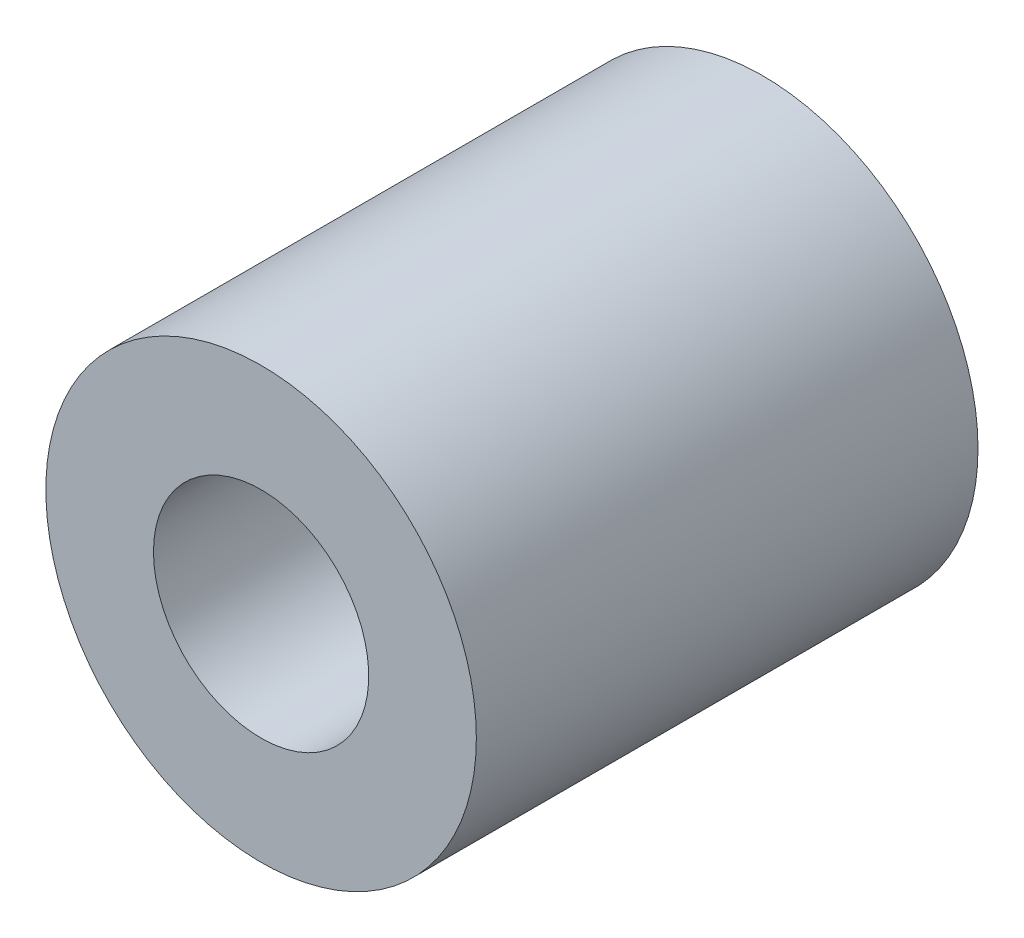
ISO-10303-21;
HEADER;
FILE_DESCRIPTION(('STEP AP214'),'2;1');
FILE_NAME('part.step','',(''),(''),'','','');
FILE_SCHEMA(('AUTOMOTIVE_DESIGN { 1 0 10303 214 1 1 1 1 }'));
ENDSEC;
DATA;
#1=APPLICATION_CONTEXT('core data for automotive mechanical design processes');
#2=APPLICATION_PROTOCOL_DEFINITION('international standard','automotive_design',2000,#1);
#3=PRODUCT_CONTEXT('',#1,'mechanical');
#4=PRODUCT('Part','Part','',(#3));
#5=PRODUCT_RELATED_PRODUCT_CATEGORY('part','',(#4));
#6=PRODUCT_DEFINITION_FORMATION('','',#4);
#7=PRODUCT_DEFINITION_CONTEXT('part definition',#1,'design');
#8=PRODUCT_DEFINITION('design','',#6,#7);
#9=PRODUCT_DEFINITION_SHAPE('','',#8);
#10=(LENGTH_UNIT() NAMED_UNIT(*) SI_UNIT(.MILLI.,.METRE.));
#11=(NAMED_UNIT(*) PLANE_ANGLE_UNIT() SI_UNIT($,.RADIAN.));
#12=(NAMED_UNIT(*) SI_UNIT($,.STERADIAN.) SOLID_ANGLE_UNIT());
#13=UNCERTAINTY_MEASURE_WITH_UNIT(LENGTH_MEASURE(1.E-05),#10,'distance_accuracy_value','');
#14=(GEOMETRIC_REPRESENTATION_CONTEXT(3) GLOBAL_UNCERTAINTY_ASSIGNED_CONTEXT((#13)) GLOBAL_UNIT_ASSIGNED_CONTEXT((#10,
#11,#12)) REPRESENTATION_CONTEXT('',''));
#15=CARTESIAN_POINT('',(0.,0.,0.));
#16=DIRECTION('',(0.,0.,1.));
#17=DIRECTION('',(1.,0.,0.));
#18=AXIS2_PLACEMENT_3D('',#15,#16,#17);
#19=CARTESIAN_POINT('',(0.,0.,6.985));
#20=DIRECTION('',(0.,0.,-1.));
#21=DIRECTION('',(-1.,0.,0.));
#22=AXIS2_PLACEMENT_3D('',#19,#20,#21);
#23=CYLINDRICAL_SURFACE('',#22,1.4986);
#24=CARTESIAN_POINT('',(0.,0.,0.));
#25=DIRECTION('',(0.,0.,-1.));
#26=DIRECTION('',(-1.,0.,0.));
#27=AXIS2_PLACEMENT_3D('',#24,#25,#26);
#28=CIRCLE('',#27,1.4986);
#29=CARTESIAN_POINT('',(-1.4986,0.,0.));
#30=VERTEX_POINT('',#29);
#31=EDGE_CURVE('E26',#30,#30,#28,.T.);
#32=ORIENTED_EDGE('',*,*,#31,.T.);
#33=EDGE_LOOP('',(#32));
#34=FACE_BOUND('',#33,.T.);
#35=CARTESIAN_POINT('',(0.,0.,6.985));
#36=DIRECTION('',(0.,0.,-1.));
#37=DIRECTION('',(-1.,0.,0.));
#38=AXIS2_PLACEMENT_3D('',#35,#36,#37);
#39=CIRCLE('',#38,1.4986);
#40=CARTESIAN_POINT('',(-1.4986,0.,6.985));
#41=VERTEX_POINT('',#40);
#42=EDGE_CURVE('E17',#41,#41,#39,.T.);
#43=ORIENTED_EDGE('',*,*,#42,.F.);
#44=EDGE_LOOP('',(#43));
#45=FACE_BOUND('',#44,.T.);
#46=ADVANCED_FACE('F14',(#34,#45),#23,.F.);
#47=CARTESIAN_POINT('',(0.,0.,6.985));
#48=DIRECTION('',(0.,0.,1.));
#49=DIRECTION('',(1.,0.,0.));
#50=AXIS2_PLACEMENT_3D('',#47,#48,#49);
#51=PLANE('',#50);
#52=ORIENTED_EDGE('',*,*,#42,.T.);
#53=EDGE_LOOP('',(#52));
#54=FACE_BOUND('',#53,.T.);
#55=CARTESIAN_POINT('',(0.,0.,6.985));
#56=DIRECTION('',(0.,0.,1.));
#57=DIRECTION('',(1.,0.,0.));
#58=AXIS2_PLACEMENT_3D('',#55,#56,#57);
#59=CIRCLE('',#58,2.9972);
#60=CARTESIAN_POINT('',(2.9972,0.,6.985));
#61=VERTEX_POINT('',#60);
#62=EDGE_CURVE('E21',#61,#61,#59,.F.);
#63=ORIENTED_EDGE('',*,*,#62,.F.);
#64=EDGE_LOOP('',(#63));
#65=FACE_BOUND('',#64,.T.);
#66=ADVANCED_FACE('F34',(#54,#65),#51,.T.);
#67=CARTESIAN_POINT('',(0.,0.,0.));
#68=DIRECTION('',(0.,0.,1.));
#69=DIRECTION('',(1.,0.,0.));
#70=AXIS2_PLACEMENT_3D('',#67,#68,#69);
#71=PLANE('',#70);
#72=ORIENTED_EDGE('',*,*,#31,.F.);
#73=EDGE_LOOP('',(#72));
#74=FACE_BOUND('',#73,.T.);
#75=CARTESIAN_POINT('',(0.,0.,0.));
#76=DIRECTION('',(0.,0.,1.));
#77=DIRECTION('',(1.,0.,0.));
#78=AXIS2_PLACEMENT_3D('',#75,#76,#77);
#79=CIRCLE('',#78,2.9972);
#80=CARTESIAN_POINT('',(2.9972,0.,0.));
#81=VERTEX_POINT('',#80);
#82=EDGE_CURVE('E10',#81,#81,#79,.T.);
#83=ORIENTED_EDGE('',*,*,#82,.F.);
#84=EDGE_LOOP('',(#83));
#85=FACE_BOUND('',#84,.T.);
#86=ADVANCED_FACE('F42',(#74,#85),#71,.F.);
#87=CARTESIAN_POINT('',(0.,0.,0.));
#88=DIRECTION('',(0.,0.,1.));
#89=DIRECTION('',(1.,0.,0.));
#90=AXIS2_PLACEMENT_3D('',#87,#88,#89);
#91=CYLINDRICAL_SURFACE('',#90,2.9972);
#92=ORIENTED_EDGE('',*,*,#62,.T.);
#93=EDGE_LOOP('',(#92));
#94=FACE_BOUND('',#93,.T.);
#95=ORIENTED_EDGE('',*,*,#82,.T.);
#96=EDGE_LOOP('',(#95));
#97=FACE_BOUND('',#96,.T.);
#98=ADVANCED_FACE('F43',(#94,#97),#91,.T.);
#99=CLOSED_SHELL('',(#46,#66,#86,#98));
#100=MANIFOLD_SOLID_BREP('B1',#99);
#101=ADVANCED_BREP_SHAPE_REPRESENTATION('',(#18,#100),#14);
#102=SHAPE_DEFINITION_REPRESENTATION(#9,#101);
ENDSEC;
END-ISO-10303-21;
